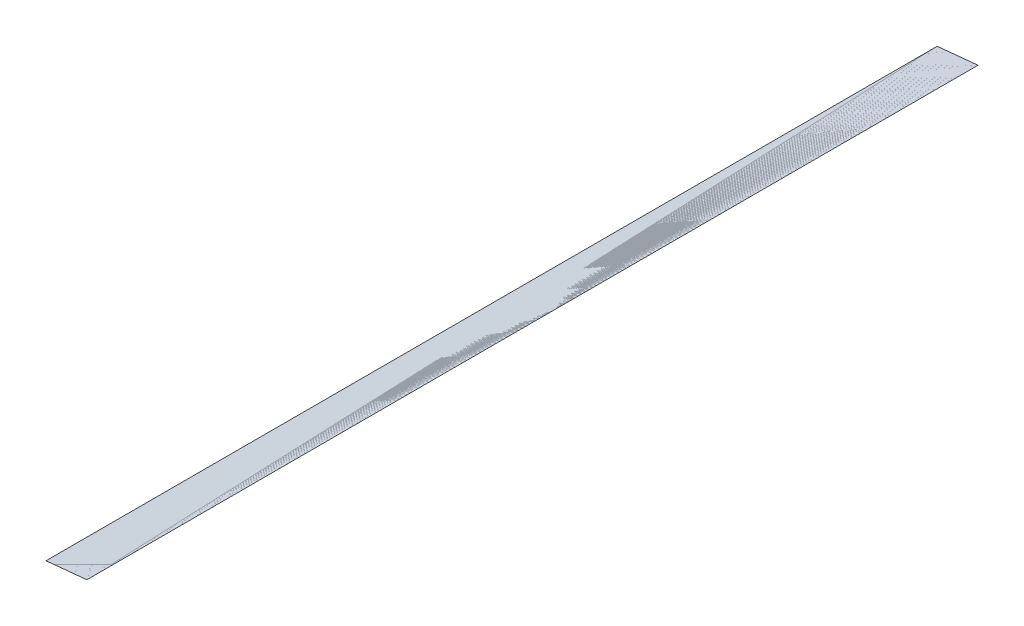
ISO-10303-21;
HEADER;
FILE_DESCRIPTION(('STEP AP214'),'2;1');
FILE_NAME('part.step','',(''),(''),'','','');
FILE_SCHEMA(('AUTOMOTIVE_DESIGN { 1 0 10303 214 1 1 1 1 }'));
ENDSEC;
DATA;
#1=APPLICATION_CONTEXT('core data for automotive mechanical design processes');
#2=APPLICATION_PROTOCOL_DEFINITION('international standard','automotive_design',2000,#1);
#3=PRODUCT_CONTEXT('',#1,'mechanical');
#4=PRODUCT('Part','Part','',(#3));
#5=PRODUCT_RELATED_PRODUCT_CATEGORY('part','',(#4));
#6=PRODUCT_DEFINITION_FORMATION('','',#4);
#7=PRODUCT_DEFINITION_CONTEXT('part definition',#1,'design');
#8=PRODUCT_DEFINITION('design','',#6,#7);
#9=PRODUCT_DEFINITION_SHAPE('','',#8);
#10=(LENGTH_UNIT() NAMED_UNIT(*) SI_UNIT(.MILLI.,.METRE.));
#11=(NAMED_UNIT(*) PLANE_ANGLE_UNIT() SI_UNIT($,.RADIAN.));
#12=(NAMED_UNIT(*) SI_UNIT($,.STERADIAN.) SOLID_ANGLE_UNIT());
#13=UNCERTAINTY_MEASURE_WITH_UNIT(LENGTH_MEASURE(1.E-05),#10,'distance_accuracy_value','');
#14=(GEOMETRIC_REPRESENTATION_CONTEXT(3) GLOBAL_UNCERTAINTY_ASSIGNED_CONTEXT((#13)) GLOBAL_UNIT_ASSIGNED_CONTEXT((#10,
#11,#12)) REPRESENTATION_CONTEXT('',''));
#15=CARTESIAN_POINT('',(0.,0.,0.));
#16=DIRECTION('',(0.,0.,1.));
#17=DIRECTION('',(1.,0.,0.));
#18=AXIS2_PLACEMENT_3D('',#15,#16,#17);
#19=CARTESIAN_POINT('',(-287.207035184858,1142.35465313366,-920.868957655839));
#20=DIRECTION('',(1.46794751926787E-06,-0.999999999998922,-2.65502651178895E-08));
#21=DIRECTION('',(-0.999999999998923,-1.46794751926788E-06,0.));
#22=AXIS2_PLACEMENT_3D('',#19,#20,#21);
#23=PLANE('',#22);
#24=CARTESIAN_POINT('',(-234.13229394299,1142.35473170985,-945.925416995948));
#25=DIRECTION('',(0.999999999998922,1.46794587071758E-06,0.));
#26=VECTOR('',#25,1.);
#27=LINE('',#24,#26);
#28=CARTESIAN_POINT('',(-234.131722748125,1142.34578418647,-945.925416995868));
#29=VERTEX_POINT('',#28);
#30=CARTESIAN_POINT('',(-234.040053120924,1142.35473184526,-945.925416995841));
#31=VERTEX_POINT('',#30);
#32=EDGE_CURVE('E43',#29,#31,#27,.T.);
#33=ORIENTED_EDGE('',*,*,#32,.T.);
#34=DIRECTION('',(0.,0.,-1.));
#35=VECTOR('',#34,1.);
#36=CARTESIAN_POINT('',(-234.040053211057,1142.35473184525,-947.925416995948));
#37=LINE('',#36,#35);
#38=CARTESIAN_POINT('',(-234.040053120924,1142.35473186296,-947.925416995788));
#39=VERTEX_POINT('',#38);
#40=EDGE_CURVE('E41',#31,#39,#37,.T.);
#41=ORIENTED_EDGE('',*,*,#40,.T.);
#42=CARTESIAN_POINT('',(-234.040052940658,1142.35473189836,-947.925416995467));
#43=DIRECTION('',(-0.999999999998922,-1.46794827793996E-06,0.));
#44=VECTOR('',#43,1.);
#45=LINE('',#42,#44);
#46=CARTESIAN_POINT('',(-234.131722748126,1142.34578421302,-947.925416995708));
#47=VERTEX_POINT('',#46);
#48=EDGE_CURVE('E28',#39,#47,#45,.T.);
#49=ORIENTED_EDGE('',*,*,#48,.T.);
#50=CARTESIAN_POINT('',(-234.13229394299,1142.35473176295,-947.925416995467));
#51=DIRECTION('',(0.,-2.65502064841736E-08,1.));
#52=VECTOR('',#51,1.);
#53=LINE('',#50,#52);
#54=EDGE_CURVE('E11',#47,#29,#53,.T.);
#55=ORIENTED_EDGE('',*,*,#54,.T.);
#56=EDGE_LOOP('',(#33,#41,#49,#55));
#57=FACE_BOUND('',#56,.T.);
#58=ADVANCED_FACE('F16',(#57),#23,.F.);
#59=CARTESIAN_POINT('',(-234.132293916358,1142.3366122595,-947.925416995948));
#60=DIRECTION('',(-0.192754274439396,0.981247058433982,0.));
#61=DIRECTION('',(0.981247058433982,0.192754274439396,0.));
#62=AXIS2_PLACEMENT_3D('',#59,#60,#61);
#63=PLANE('',#62);
#64=ORIENTED_EDGE('',*,*,#48,.F.);
#65=ORIENTED_EDGE('',*,*,#40,.F.);
#66=ORIENTED_EDGE('',*,*,#32,.F.);
#67=ORIENTED_EDGE('',*,*,#54,.F.);
#68=EDGE_LOOP('',(#64,#65,#66,#67));
#69=FACE_BOUND('',#68,.T.);
#70=ADVANCED_FACE('F18',(#69),#63,.F.);
#71=CLOSED_SHELL('',(#58,#70));
#72=MANIFOLD_SOLID_BREP('B1',#71);
#73=ADVANCED_BREP_SHAPE_REPRESENTATION('',(#18,#72),#14);
#74=SHAPE_DEFINITION_REPRESENTATION(#9,#73);
ENDSEC;
END-ISO-10303-21;
